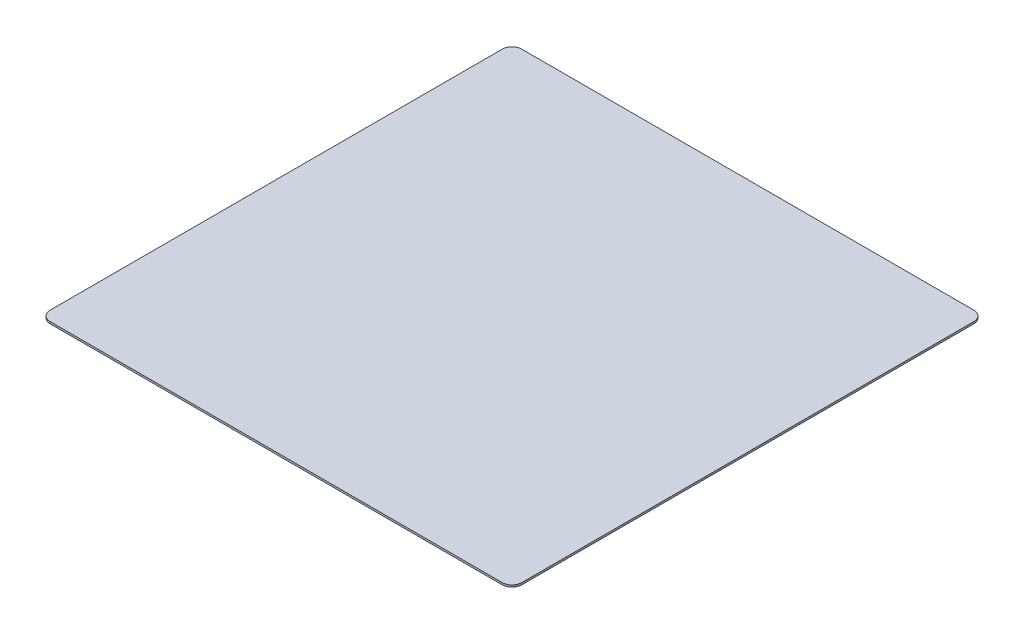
ISO-10303-21;
HEADER;
FILE_DESCRIPTION(('STEP AP214'),'2;1');
FILE_NAME('part.step','',(''),(''),'','','');
FILE_SCHEMA(('AUTOMOTIVE_DESIGN { 1 0 10303 214 1 1 1 1 }'));
ENDSEC;
DATA;
#1=APPLICATION_CONTEXT('core data for automotive mechanical design processes');
#2=APPLICATION_PROTOCOL_DEFINITION('international standard','automotive_design',2000,#1);
#3=PRODUCT_CONTEXT('',#1,'mechanical');
#4=PRODUCT('Part','Part','',(#3));
#5=PRODUCT_RELATED_PRODUCT_CATEGORY('part','',(#4));
#6=PRODUCT_DEFINITION_FORMATION('','',#4);
#7=PRODUCT_DEFINITION_CONTEXT('part definition',#1,'design');
#8=PRODUCT_DEFINITION('design','',#6,#7);
#9=PRODUCT_DEFINITION_SHAPE('','',#8);
#10=(LENGTH_UNIT() NAMED_UNIT(*) SI_UNIT(.MILLI.,.METRE.));
#11=(NAMED_UNIT(*) PLANE_ANGLE_UNIT() SI_UNIT($,.RADIAN.));
#12=(NAMED_UNIT(*) SI_UNIT($,.STERADIAN.) SOLID_ANGLE_UNIT());
#13=UNCERTAINTY_MEASURE_WITH_UNIT(LENGTH_MEASURE(1.E-05),#10,'distance_accuracy_value','');
#14=(GEOMETRIC_REPRESENTATION_CONTEXT(3) GLOBAL_UNCERTAINTY_ASSIGNED_CONTEXT((#13)) GLOBAL_UNIT_ASSIGNED_CONTEXT((#10,
#11,#12)) REPRESENTATION_CONTEXT('',''));
#15=CARTESIAN_POINT('',(0.,0.,0.));
#16=DIRECTION('',(0.,0.,1.));
#17=DIRECTION('',(1.,0.,0.));
#18=AXIS2_PLACEMENT_3D('',#15,#16,#17);
#19=CARTESIAN_POINT('',(-12.2260273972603,0.1,18.9930136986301));
#20=DIRECTION('',(1.,0.,0.));
#21=DIRECTION('',(0.,0.,-1.));
#22=AXIS2_PLACEMENT_3D('',#19,#20,#21);
#23=PLANE('',#22);
#24=DIRECTION('',(0.,0.,1.));
#25=VECTOR('',#24,1.);
#26=CARTESIAN_POINT('',(-12.2260273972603,0.1,18.9930136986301));
#27=LINE('',#26,#25);
#28=CARTESIAN_POINT('',(-12.2260273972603,0.1,-4.63698630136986));
#29=VERTEX_POINT('',#28);
#30=CARTESIAN_POINT('',(-12.2260273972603,0.1,18.4930136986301));
#31=VERTEX_POINT('',#30);
#32=EDGE_CURVE('E126',#29,#31,#27,.T.);
#33=ORIENTED_EDGE('',*,*,#32,.F.);
#34=DIRECTION('',(0.,-1.,0.));
#35=VECTOR('',#34,1.);
#36=CARTESIAN_POINT('',(-12.2260273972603,0.1,-4.63698630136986));
#37=LINE('',#36,#35);
#38=CARTESIAN_POINT('',(-12.2260273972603,0.,-4.63698630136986));
#39=VERTEX_POINT('',#38);
#40=EDGE_CURVE('E11',#29,#39,#37,.T.);
#41=ORIENTED_EDGE('',*,*,#40,.T.);
#42=DIRECTION('',(0.,0.,1.));
#43=VECTOR('',#42,1.);
#44=CARTESIAN_POINT('',(-12.2260273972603,0.,18.9930136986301));
#45=LINE('',#44,#43);
#46=CARTESIAN_POINT('',(-12.2260273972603,0.,18.4930136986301));
#47=VERTEX_POINT('',#46);
#48=EDGE_CURVE('E157',#39,#47,#45,.T.);
#49=ORIENTED_EDGE('',*,*,#48,.T.);
#50=DIRECTION('',(0.,-1.,0.));
#51=VECTOR('',#50,1.);
#52=CARTESIAN_POINT('',(-12.2260273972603,0.1,18.4930136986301));
#53=LINE('',#52,#51);
#54=EDGE_CURVE('E40',#47,#31,#53,.F.);
#55=ORIENTED_EDGE('',*,*,#54,.T.);
#56=EDGE_LOOP('',(#33,#41,#49,#55));
#57=FACE_BOUND('',#56,.T.);
#58=ADVANCED_FACE('F32',(#57),#23,.F.);
#59=CARTESIAN_POINT('',(-12.2260273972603,0.1,18.9930136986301));
#60=DIRECTION('',(0.,0.,-1.));
#61=DIRECTION('',(-1.,0.,0.));
#62=AXIS2_PLACEMENT_3D('',#59,#60,#61);
#63=PLANE('',#62);
#64=DIRECTION('',(1.,0.,0.));
#65=VECTOR('',#64,1.);
#66=CARTESIAN_POINT('',(-12.2260273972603,0.,18.9930136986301));
#67=LINE('',#66,#65);
#68=CARTESIAN_POINT('',(-11.7260273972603,0.,18.9930136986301));
#69=VERTEX_POINT('',#68);
#70=CARTESIAN_POINT('',(11.4039726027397,0.,18.9930136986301));
#71=VERTEX_POINT('',#70);
#72=EDGE_CURVE('E131',#69,#71,#67,.T.);
#73=ORIENTED_EDGE('',*,*,#72,.T.);
#74=DIRECTION('',(0.,-1.,0.));
#75=VECTOR('',#74,1.);
#76=CARTESIAN_POINT('',(11.4039726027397,0.1,18.9930136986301));
#77=LINE('',#76,#75);
#78=CARTESIAN_POINT('',(11.4039726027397,0.1,18.9930136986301));
#79=VERTEX_POINT('',#78);
#80=EDGE_CURVE('E47',#71,#79,#77,.F.);
#81=ORIENTED_EDGE('',*,*,#80,.T.);
#82=DIRECTION('',(1.,0.,0.));
#83=VECTOR('',#82,1.);
#84=CARTESIAN_POINT('',(-12.2260273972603,0.1,18.9930136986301));
#85=LINE('',#84,#83);
#86=CARTESIAN_POINT('',(-11.7260273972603,0.1,18.9930136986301));
#87=VERTEX_POINT('',#86);
#88=EDGE_CURVE('E129',#87,#79,#85,.T.);
#89=ORIENTED_EDGE('',*,*,#88,.F.);
#90=DIRECTION('',(0.,-1.,0.));
#91=VECTOR('',#90,1.);
#92=CARTESIAN_POINT('',(-11.7260273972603,0.1,18.9930136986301));
#93=LINE('',#92,#91);
#94=EDGE_CURVE('E149',#87,#69,#93,.T.);
#95=ORIENTED_EDGE('',*,*,#94,.T.);
#96=EDGE_LOOP('',(#73,#81,#89,#95));
#97=FACE_BOUND('',#96,.T.);
#98=ADVANCED_FACE('F164',(#97),#63,.F.);
#99=CARTESIAN_POINT('',(11.9039726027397,0.1,18.9930136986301));
#100=DIRECTION('',(-1.,0.,0.));
#101=DIRECTION('',(0.,0.,1.));
#102=AXIS2_PLACEMENT_3D('',#99,#100,#101);
#103=PLANE('',#102);
#104=DIRECTION('',(0.,0.,-1.));
#105=VECTOR('',#104,1.);
#106=CARTESIAN_POINT('',(11.9039726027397,0.,18.9930136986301));
#107=LINE('',#106,#105);
#108=CARTESIAN_POINT('',(11.9039726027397,0.,18.4930136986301));
#109=VERTEX_POINT('',#108);
#110=CARTESIAN_POINT('',(11.9039726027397,0.,-4.63698630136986));
#111=VERTEX_POINT('',#110);
#112=EDGE_CURVE('E127',#109,#111,#107,.T.);
#113=ORIENTED_EDGE('',*,*,#112,.T.);
#114=DIRECTION('',(0.,-1.,0.));
#115=VECTOR('',#114,1.);
#116=CARTESIAN_POINT('',(11.9039726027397,0.1,-4.63698630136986));
#117=LINE('',#116,#115);
#118=CARTESIAN_POINT('',(11.9039726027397,0.1,-4.63698630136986));
#119=VERTEX_POINT('',#118);
#120=EDGE_CURVE('E104',#111,#119,#117,.F.);
#121=ORIENTED_EDGE('',*,*,#120,.T.);
#122=DIRECTION('',(0.,0.,-1.));
#123=VECTOR('',#122,1.);
#124=CARTESIAN_POINT('',(11.9039726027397,0.1,18.9930136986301));
#125=LINE('',#124,#123);
#126=CARTESIAN_POINT('',(11.9039726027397,0.1,18.4930136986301));
#127=VERTEX_POINT('',#126);
#128=EDGE_CURVE('E168',#127,#119,#125,.T.);
#129=ORIENTED_EDGE('',*,*,#128,.F.);
#130=DIRECTION('',(0.,-1.,0.));
#131=VECTOR('',#130,1.);
#132=CARTESIAN_POINT('',(11.9039726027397,0.1,18.4930136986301));
#133=LINE('',#132,#131);
#134=EDGE_CURVE('E109',#127,#109,#133,.T.);
#135=ORIENTED_EDGE('',*,*,#134,.T.);
#136=EDGE_LOOP('',(#113,#121,#129,#135));
#137=FACE_BOUND('',#136,.T.);
#138=ADVANCED_FACE('F176',(#137),#103,.F.);
#139=CARTESIAN_POINT('',(-12.2260273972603,0.1,-5.13698630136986));
#140=DIRECTION('',(0.,0.,1.));
#141=DIRECTION('',(1.,0.,0.));
#142=AXIS2_PLACEMENT_3D('',#139,#140,#141);
#143=PLANE('',#142);
#144=DIRECTION('',(-1.,0.,0.));
#145=VECTOR('',#144,1.);
#146=CARTESIAN_POINT('',(-12.2260273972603,0.1,-5.13698630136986));
#147=LINE('',#146,#145);
#148=CARTESIAN_POINT('',(11.4039726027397,0.1,-5.13698630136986));
#149=VERTEX_POINT('',#148);
#150=CARTESIAN_POINT('',(-11.7260273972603,0.1,-5.13698630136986));
#151=VERTEX_POINT('',#150);
#152=EDGE_CURVE('E119',#149,#151,#147,.T.);
#153=ORIENTED_EDGE('',*,*,#152,.F.);
#154=DIRECTION('',(0.,-1.,0.));
#155=VECTOR('',#154,1.);
#156=CARTESIAN_POINT('',(11.4039726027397,0.1,-5.13698630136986));
#157=LINE('',#156,#155);
#158=CARTESIAN_POINT('',(11.4039726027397,0.,-5.13698630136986));
#159=VERTEX_POINT('',#158);
#160=EDGE_CURVE('E103',#149,#159,#157,.T.);
#161=ORIENTED_EDGE('',*,*,#160,.T.);
#162=DIRECTION('',(-1.,0.,0.));
#163=VECTOR('',#162,1.);
#164=CARTESIAN_POINT('',(-12.2260273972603,0.,-5.13698630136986));
#165=LINE('',#164,#163);
#166=CARTESIAN_POINT('',(-11.7260273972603,0.,-5.13698630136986));
#167=VERTEX_POINT('',#166);
#168=EDGE_CURVE('E116',#159,#167,#165,.T.);
#169=ORIENTED_EDGE('',*,*,#168,.T.);
#170=DIRECTION('',(0.,-1.,0.));
#171=VECTOR('',#170,1.);
#172=CARTESIAN_POINT('',(-11.7260273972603,0.1,-5.13698630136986));
#173=LINE('',#172,#171);
#174=EDGE_CURVE('E121',#167,#151,#173,.F.);
#175=ORIENTED_EDGE('',*,*,#174,.T.);
#176=EDGE_LOOP('',(#153,#161,#169,#175));
#177=FACE_BOUND('',#176,.T.);
#178=ADVANCED_FACE('F115',(#177),#143,.F.);
#179=CARTESIAN_POINT('',(0.,0.1,0.));
#180=DIRECTION('',(0.,-1.,0.));
#181=DIRECTION('',(0.,0.,-1.));
#182=AXIS2_PLACEMENT_3D('',#179,#180,#181);
#183=PLANE('',#182);
#184=ORIENTED_EDGE('',*,*,#128,.T.);
#185=CARTESIAN_POINT('',(11.4039726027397,0.1,-4.63698630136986));
#186=DIRECTION('',(0.,-1.,0.));
#187=DIRECTION('',(0.,0.,-1.));
#188=AXIS2_PLACEMENT_3D('',#185,#186,#187);
#189=CIRCLE('',#188,0.5);
#190=EDGE_CURVE('E147',#119,#149,#189,.F.);
#191=ORIENTED_EDGE('',*,*,#190,.T.);
#192=ORIENTED_EDGE('',*,*,#152,.T.);
#193=CARTESIAN_POINT('',(-11.7260273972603,0.1,-4.63698630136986));
#194=DIRECTION('',(0.,-1.,0.));
#195=DIRECTION('',(0.,0.,-1.));
#196=AXIS2_PLACEMENT_3D('',#193,#194,#195);
#197=CIRCLE('',#196,0.5);
#198=EDGE_CURVE('E143',#151,#29,#197,.F.);
#199=ORIENTED_EDGE('',*,*,#198,.T.);
#200=ORIENTED_EDGE('',*,*,#32,.T.);
#201=CARTESIAN_POINT('',(-11.7260273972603,0.1,18.4930136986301));
#202=DIRECTION('',(0.,-1.,0.));
#203=DIRECTION('',(0.,0.,-1.));
#204=AXIS2_PLACEMENT_3D('',#201,#202,#203);
#205=CIRCLE('',#204,0.5);
#206=EDGE_CURVE('E54',#31,#87,#205,.F.);
#207=ORIENTED_EDGE('',*,*,#206,.T.);
#208=ORIENTED_EDGE('',*,*,#88,.T.);
#209=CARTESIAN_POINT('',(11.4039726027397,0.1,18.4930136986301));
#210=DIRECTION('',(0.,-1.,0.));
#211=DIRECTION('',(0.,0.,-1.));
#212=AXIS2_PLACEMENT_3D('',#209,#210,#211);
#213=CIRCLE('',#212,0.5);
#214=EDGE_CURVE('E145',#79,#127,#213,.F.);
#215=ORIENTED_EDGE('',*,*,#214,.T.);
#216=EDGE_LOOP('',(#184,#191,#192,#199,#200,#207,#208,#215));
#217=FACE_BOUND('',#216,.T.);
#218=ADVANCED_FACE('F160',(#217),#183,.F.);
#219=CARTESIAN_POINT('',(0.,0.,0.));
#220=DIRECTION('',(0.,-1.,0.));
#221=DIRECTION('',(0.,0.,-1.));
#222=AXIS2_PLACEMENT_3D('',#219,#220,#221);
#223=PLANE('',#222);
#224=ORIENTED_EDGE('',*,*,#168,.F.);
#225=CARTESIAN_POINT('',(11.4039726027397,0.,-4.63698630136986));
#226=DIRECTION('',(0.,-1.,0.));
#227=DIRECTION('',(0.,0.,-1.));
#228=AXIS2_PLACEMENT_3D('',#225,#226,#227);
#229=CIRCLE('',#228,0.5);
#230=EDGE_CURVE('E99',#159,#111,#229,.T.);
#231=ORIENTED_EDGE('',*,*,#230,.T.);
#232=ORIENTED_EDGE('',*,*,#112,.F.);
#233=CARTESIAN_POINT('',(11.4039726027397,0.,18.4930136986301));
#234=DIRECTION('',(0.,-1.,0.));
#235=DIRECTION('',(0.,0.,-1.));
#236=AXIS2_PLACEMENT_3D('',#233,#234,#235);
#237=CIRCLE('',#236,0.5);
#238=EDGE_CURVE('E110',#109,#71,#237,.T.);
#239=ORIENTED_EDGE('',*,*,#238,.T.);
#240=ORIENTED_EDGE('',*,*,#72,.F.);
#241=CARTESIAN_POINT('',(-11.7260273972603,0.,18.4930136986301));
#242=DIRECTION('',(0.,-1.,0.));
#243=DIRECTION('',(0.,0.,-1.));
#244=AXIS2_PLACEMENT_3D('',#241,#242,#243);
#245=CIRCLE('',#244,0.5);
#246=EDGE_CURVE('E120',#69,#47,#245,.T.);
#247=ORIENTED_EDGE('',*,*,#246,.T.);
#248=ORIENTED_EDGE('',*,*,#48,.F.);
#249=CARTESIAN_POINT('',(-11.7260273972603,0.,-4.63698630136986));
#250=DIRECTION('',(0.,-1.,0.));
#251=DIRECTION('',(0.,0.,-1.));
#252=AXIS2_PLACEMENT_3D('',#249,#250,#251);
#253=CIRCLE('',#252,0.5);
#254=EDGE_CURVE('E125',#39,#167,#253,.T.);
#255=ORIENTED_EDGE('',*,*,#254,.T.);
#256=EDGE_LOOP('',(#224,#231,#232,#239,#240,#247,#248,#255));
#257=FACE_BOUND('',#256,.T.);
#258=ADVANCED_FACE('F123',(#257),#223,.T.);
#259=CARTESIAN_POINT('',(11.4039726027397,0.1,-4.63698630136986));
#260=DIRECTION('',(0.,-1.,0.));
#261=DIRECTION('',(0.,0.,-1.));
#262=AXIS2_PLACEMENT_3D('',#259,#260,#261);
#263=CYLINDRICAL_SURFACE('',#262,0.5);
#264=ORIENTED_EDGE('',*,*,#190,.F.);
#265=ORIENTED_EDGE('',*,*,#120,.F.);
#266=ORIENTED_EDGE('',*,*,#230,.F.);
#267=ORIENTED_EDGE('',*,*,#160,.F.);
#268=EDGE_LOOP('',(#264,#265,#266,#267));
#269=FACE_BOUND('',#268,.T.);
#270=ADVANCED_FACE('F102',(#269),#263,.T.);
#271=CARTESIAN_POINT('',(11.4039726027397,0.1,18.4930136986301));
#272=DIRECTION('',(0.,-1.,0.));
#273=DIRECTION('',(0.,0.,-1.));
#274=AXIS2_PLACEMENT_3D('',#271,#272,#273);
#275=CYLINDRICAL_SURFACE('',#274,0.5);
#276=ORIENTED_EDGE('',*,*,#214,.F.);
#277=ORIENTED_EDGE('',*,*,#80,.F.);
#278=ORIENTED_EDGE('',*,*,#238,.F.);
#279=ORIENTED_EDGE('',*,*,#134,.F.);
#280=EDGE_LOOP('',(#276,#277,#278,#279));
#281=FACE_BOUND('',#280,.T.);
#282=ADVANCED_FACE('F174',(#281),#275,.T.);
#283=CARTESIAN_POINT('',(-11.7260273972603,0.1,-4.63698630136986));
#284=DIRECTION('',(0.,-1.,0.));
#285=DIRECTION('',(0.,0.,-1.));
#286=AXIS2_PLACEMENT_3D('',#283,#284,#285);
#287=CYLINDRICAL_SURFACE('',#286,0.5);
#288=ORIENTED_EDGE('',*,*,#198,.F.);
#289=ORIENTED_EDGE('',*,*,#174,.F.);
#290=ORIENTED_EDGE('',*,*,#254,.F.);
#291=ORIENTED_EDGE('',*,*,#40,.F.);
#292=EDGE_LOOP('',(#288,#289,#290,#291));
#293=FACE_BOUND('',#292,.T.);
#294=ADVANCED_FACE('F178',(#293),#287,.T.);
#295=CARTESIAN_POINT('',(-11.7260273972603,0.1,18.4930136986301));
#296=DIRECTION('',(0.,-1.,0.));
#297=DIRECTION('',(0.,0.,-1.));
#298=AXIS2_PLACEMENT_3D('',#295,#296,#297);
#299=CYLINDRICAL_SURFACE('',#298,0.5);
#300=ORIENTED_EDGE('',*,*,#206,.F.);
#301=ORIENTED_EDGE('',*,*,#54,.F.);
#302=ORIENTED_EDGE('',*,*,#246,.F.);
#303=ORIENTED_EDGE('',*,*,#94,.F.);
#304=EDGE_LOOP('',(#300,#301,#302,#303));
#305=FACE_BOUND('',#304,.T.);
#306=ADVANCED_FACE('F34',(#305),#299,.T.);
#307=CLOSED_SHELL('',(#58,#98,#138,#178,#218,#258,#270,#282,#294,#306));
#308=MANIFOLD_SOLID_BREP('B2',#307);
#309=ADVANCED_BREP_SHAPE_REPRESENTATION('',(#18,#308),#14);
#310=SHAPE_DEFINITION_REPRESENTATION(#9,#309);
ENDSEC;
END-ISO-10303-21;
